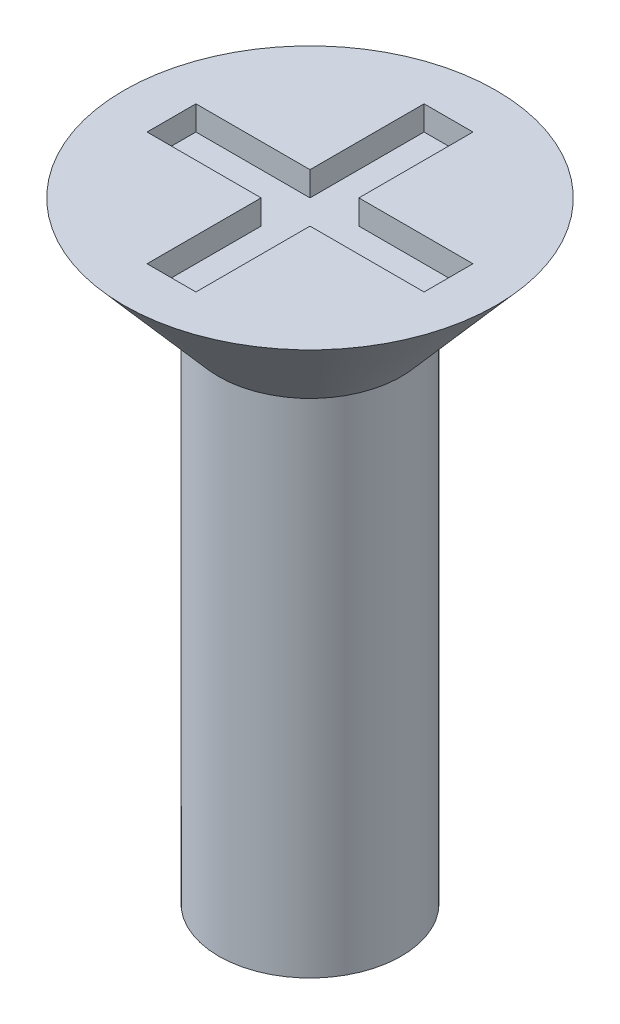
ISO-10303-21;
HEADER;
FILE_DESCRIPTION(('STEP AP214'),'2;1');
FILE_NAME('part.step','',(''),(''),'','','');
FILE_SCHEMA(('AUTOMOTIVE_DESIGN { 1 0 10303 214 1 1 1 1 }'));
ENDSEC;
DATA;
#1=APPLICATION_CONTEXT('core data for automotive mechanical design processes');
#2=APPLICATION_PROTOCOL_DEFINITION('international standard','automotive_design',2000,#1);
#3=PRODUCT_CONTEXT('',#1,'mechanical');
#4=PRODUCT('Part','Part','',(#3));
#5=PRODUCT_RELATED_PRODUCT_CATEGORY('part','',(#4));
#6=PRODUCT_DEFINITION_FORMATION('','',#4);
#7=PRODUCT_DEFINITION_CONTEXT('part definition',#1,'design');
#8=PRODUCT_DEFINITION('design','',#6,#7);
#9=PRODUCT_DEFINITION_SHAPE('','',#8);
#10=(LENGTH_UNIT() NAMED_UNIT(*) SI_UNIT(.MILLI.,.METRE.));
#11=(NAMED_UNIT(*) PLANE_ANGLE_UNIT() SI_UNIT($,.RADIAN.));
#12=(NAMED_UNIT(*) SI_UNIT($,.STERADIAN.) SOLID_ANGLE_UNIT());
#13=UNCERTAINTY_MEASURE_WITH_UNIT(LENGTH_MEASURE(1.E-05),#10,'distance_accuracy_value','');
#14=(GEOMETRIC_REPRESENTATION_CONTEXT(3) GLOBAL_UNCERTAINTY_ASSIGNED_CONTEXT((#13)) GLOBAL_UNIT_ASSIGNED_CONTEXT((#10,
#11,#12)) REPRESENTATION_CONTEXT('',''));
#15=CARTESIAN_POINT('',(0.,0.,0.));
#16=DIRECTION('',(0.,0.,1.));
#17=DIRECTION('',(1.,0.,0.));
#18=AXIS2_PLACEMENT_3D('',#15,#16,#17);
#19=CARTESIAN_POINT('',(2.90175217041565,9.525,0.));
#20=DIRECTION('',(0.,-1.,0.));
#21=DIRECTION('',(0.,0.,-1.));
#22=AXIS2_PLACEMENT_3D('',#19,#20,#21);
#23=PLANE('',#22);
#24=CARTESIAN_POINT('',(0.,9.52500000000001,0.));
#25=DIRECTION('',(0.,1.,0.));
#26=DIRECTION('',(0.,0.,1.));
#27=AXIS2_PLACEMENT_3D('',#24,#25,#26);
#28=CIRCLE('',#27,2.90175217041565);
#29=CARTESIAN_POINT('',(0.,9.52500000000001,2.90175217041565));
#30=VERTEX_POINT('',#29);
#31=EDGE_CURVE('E230',#30,#30,#28,.T.);
#32=ORIENTED_EDGE('',*,*,#31,.T.);
#33=EDGE_LOOP('',(#32));
#34=FACE_BOUND('',#33,.T.);
#35=DIRECTION('',(-1.,0.,1.49574716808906E-09));
#36=VECTOR('',#35,1.);
#37=CARTESIAN_POINT('',(5.69879661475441E-10,9.525,0.381));
#38=LINE('',#37,#36);
#39=CARTESIAN_POINT('',(-0.381,9.525,0.381000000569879));
#40=VERTEX_POINT('',#39);
#41=CARTESIAN_POINT('',(-2.15899999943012,9.525,0.381000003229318));
#42=VERTEX_POINT('',#41);
#43=EDGE_CURVE('E188',#40,#42,#38,.T.);
#44=ORIENTED_EDGE('',*,*,#43,.T.);
#45=DIRECTION('',(1.49574714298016E-09,0.,1.));
#46=VECTOR('',#45,1.);
#47=CARTESIAN_POINT('',(-2.15900000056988,9.525,-0.380999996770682));
#48=LINE('',#47,#46);
#49=CARTESIAN_POINT('',(-2.15900000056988,9.525,-0.380999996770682));
#50=VERTEX_POINT('',#49);
#51=EDGE_CURVE('E200',#50,#42,#48,.T.);
#52=ORIENTED_EDGE('',*,*,#51,.F.);
#53=DIRECTION('',(1.,0.,-1.49574729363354E-09));
#54=VECTOR('',#53,1.);
#55=CARTESIAN_POINT('',(-2.15900000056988,9.525,-0.380999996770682));
#56=LINE('',#55,#54);
#57=CARTESIAN_POINT('',(-0.381000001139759,9.525,-0.381));
#58=VERTEX_POINT('',#57);
#59=EDGE_CURVE('E203',#50,#58,#56,.T.);
#60=ORIENTED_EDGE('',*,*,#59,.T.);
#61=DIRECTION('',(-2.99149431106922E-09,0.,-1.));
#62=VECTOR('',#61,1.);
#63=CARTESIAN_POINT('',(-0.381,9.525,1.13975932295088E-09));
#64=LINE('',#63,#62);
#65=CARTESIAN_POINT('',(-0.381000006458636,9.525,-2.15899999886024));
#66=VERTEX_POINT('',#65);
#67=EDGE_CURVE('E166',#58,#66,#64,.T.);
#68=ORIENTED_EDGE('',*,*,#67,.T.);
#69=DIRECTION('',(-1.,0.,2.99149428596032E-09));
#70=VECTOR('',#69,1.);
#71=CARTESIAN_POINT('',(0.380999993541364,9.525,-2.15900000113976));
#72=LINE('',#71,#70);
#73=CARTESIAN_POINT('',(0.380999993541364,9.525,-2.15900000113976));
#74=VERTEX_POINT('',#73);
#75=EDGE_CURVE('E178',#74,#66,#72,.T.);
#76=ORIENTED_EDGE('',*,*,#75,.F.);
#77=DIRECTION('',(2.99149443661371E-09,0.,1.));
#78=VECTOR('',#77,1.);
#79=CARTESIAN_POINT('',(0.380999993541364,9.525,-2.15900000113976));
#80=LINE('',#79,#78);
#81=CARTESIAN_POINT('',(0.381,9.525,-0.381000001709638));
#82=VERTEX_POINT('',#81);
#83=EDGE_CURVE('E170',#74,#82,#80,.T.);
#84=ORIENTED_EDGE('',*,*,#83,.T.);
#85=DIRECTION('',(1.,0.,-4.48724100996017E-09));
#86=VECTOR('',#85,1.);
#87=CARTESIAN_POINT('',(-1.70963881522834E-09,9.525,-0.381));
#88=LINE('',#87,#86);
#89=CARTESIAN_POINT('',(2.15899999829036,9.525,-0.381000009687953));
#90=VERTEX_POINT('',#89);
#91=EDGE_CURVE('E162',#82,#90,#88,.T.);
#92=ORIENTED_EDGE('',*,*,#91,.T.);
#93=DIRECTION('',(-4.48724098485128E-09,0.,-1.));
#94=VECTOR('',#93,1.);
#95=CARTESIAN_POINT('',(2.15900000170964,9.525,0.380999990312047));
#96=LINE('',#95,#94);
#97=CARTESIAN_POINT('',(2.15900000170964,9.525,0.380999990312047));
#98=VERTEX_POINT('',#97);
#99=EDGE_CURVE('E145',#98,#90,#96,.T.);
#100=ORIENTED_EDGE('',*,*,#99,.F.);
#101=CARTESIAN_POINT('',(0.381,9.525,0.38099999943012));
#102=VERTEX_POINT('',#101);
#103=EDGE_CURVE('E198',#98,#102,#38,.T.);
#104=ORIENTED_EDGE('',*,*,#103,.T.);
#105=DIRECTION('',(0.,0.,1.));
#106=VECTOR('',#105,1.);
#107=CARTESIAN_POINT('',(0.381,9.525,0.));
#108=LINE('',#107,#106);
#109=CARTESIAN_POINT('',(0.381,9.525,2.159));
#110=VERTEX_POINT('',#109);
#111=EDGE_CURVE('E67',#102,#110,#108,.T.);
#112=ORIENTED_EDGE('',*,*,#111,.T.);
#113=DIRECTION('',(1.,0.,0.));
#114=VECTOR('',#113,1.);
#115=CARTESIAN_POINT('',(-0.381,9.525,2.159));
#116=LINE('',#115,#114);
#117=CARTESIAN_POINT('',(-0.381,9.525,2.159));
#118=VERTEX_POINT('',#117);
#119=EDGE_CURVE('E222',#118,#110,#116,.T.);
#120=ORIENTED_EDGE('',*,*,#119,.F.);
#121=DIRECTION('',(0.,0.,-1.));
#122=VECTOR('',#121,1.);
#123=CARTESIAN_POINT('',(-0.381,9.525,2.159));
#124=LINE('',#123,#122);
#125=EDGE_CURVE('E216',#118,#40,#124,.T.);
#126=ORIENTED_EDGE('',*,*,#125,.T.);
#127=EDGE_LOOP('',(#44,#52,#60,#68,#76,#84,#92,#100,#104,#112,#120,#126));
#128=FACE_BOUND('',#127,.T.);
#129=ADVANCED_FACE('F38',(#34,#128),#23,.F.);
#130=CARTESIAN_POINT('',(0.381,9.144,0.));
#131=DIRECTION('',(-1.,0.,0.));
#132=DIRECTION('',(0.,0.,1.));
#133=AXIS2_PLACEMENT_3D('',#130,#131,#132);
#134=PLANE('',#133);
#135=ORIENTED_EDGE('',*,*,#111,.F.);
#136=DIRECTION('',(0.,-1.,0.));
#137=VECTOR('',#136,1.);
#138=CARTESIAN_POINT('',(0.381,9.144,0.38099999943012));
#139=LINE('',#138,#137);
#140=CARTESIAN_POINT('',(0.381,9.144,0.38099999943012));
#141=VERTEX_POINT('',#140);
#142=EDGE_CURVE('E210',#102,#141,#139,.T.);
#143=ORIENTED_EDGE('',*,*,#142,.T.);
#144=DIRECTION('',(0.,0.,1.));
#145=VECTOR('',#144,1.);
#146=CARTESIAN_POINT('',(0.381,9.144,0.));
#147=LINE('',#146,#145);
#148=CARTESIAN_POINT('',(0.381,9.144,2.159));
#149=VERTEX_POINT('',#148);
#150=EDGE_CURVE('E213',#141,#149,#147,.T.);
#151=ORIENTED_EDGE('',*,*,#150,.T.);
#152=DIRECTION('',(0.,1.,0.));
#153=VECTOR('',#152,1.);
#154=CARTESIAN_POINT('',(0.381,9.144,2.159));
#155=LINE('',#154,#153);
#156=EDGE_CURVE('E228',#149,#110,#155,.T.);
#157=ORIENTED_EDGE('',*,*,#156,.T.);
#158=EDGE_LOOP('',(#135,#143,#151,#157));
#159=FACE_BOUND('',#158,.T.);
#160=ADVANCED_FACE('F247',(#159),#134,.T.);
#161=CARTESIAN_POINT('',(-0.381,9.144,2.159));
#162=DIRECTION('',(1.,0.,0.));
#163=DIRECTION('',(0.,0.,-1.));
#164=AXIS2_PLACEMENT_3D('',#161,#162,#163);
#165=PLANE('',#164);
#166=DIRECTION('',(0.,0.,-1.));
#167=VECTOR('',#166,1.);
#168=CARTESIAN_POINT('',(-0.381,9.144,2.159));
#169=LINE('',#168,#167);
#170=CARTESIAN_POINT('',(-0.381,9.144,2.159));
#171=VERTEX_POINT('',#170);
#172=CARTESIAN_POINT('',(-0.381,9.144,0.381000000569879));
#173=VERTEX_POINT('',#172);
#174=EDGE_CURVE('E219',#171,#173,#169,.T.);
#175=ORIENTED_EDGE('',*,*,#174,.T.);
#176=DIRECTION('',(0.,1.,0.));
#177=VECTOR('',#176,1.);
#178=CARTESIAN_POINT('',(-0.381,9.144,0.381000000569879));
#179=LINE('',#178,#177);
#180=EDGE_CURVE('E75',#173,#40,#179,.T.);
#181=ORIENTED_EDGE('',*,*,#180,.T.);
#182=ORIENTED_EDGE('',*,*,#125,.F.);
#183=DIRECTION('',(0.,1.,0.));
#184=VECTOR('',#183,1.);
#185=CARTESIAN_POINT('',(-0.381,9.144,2.159));
#186=LINE('',#185,#184);
#187=EDGE_CURVE('E55',#171,#118,#186,.T.);
#188=ORIENTED_EDGE('',*,*,#187,.F.);
#189=EDGE_LOOP('',(#175,#181,#182,#188));
#190=FACE_BOUND('',#189,.T.);
#191=ADVANCED_FACE('F243',(#190),#165,.T.);
#192=CARTESIAN_POINT('',(0.,0.,0.));
#193=DIRECTION('',(0.,1.,0.));
#194=DIRECTION('',(0.,0.,1.));
#195=AXIS2_PLACEMENT_3D('',#192,#193,#194);
#196=PLANE('',#195);
#197=CARTESIAN_POINT('',(0.,0.,0.));
#198=DIRECTION('',(0.,1.,0.));
#199=DIRECTION('',(0.,0.,1.));
#200=AXIS2_PLACEMENT_3D('',#197,#198,#199);
#201=CIRCLE('',#200,1.42240000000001);
#202=CARTESIAN_POINT('',(0.,0.,1.42240000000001));
#203=VERTEX_POINT('',#202);
#204=EDGE_CURVE('E11',#203,#203,#201,.T.);
#205=ORIENTED_EDGE('',*,*,#204,.F.);
#206=EDGE_LOOP('',(#205));
#207=FACE_BOUND('',#206,.T.);
#208=ADVANCED_FACE('F40',(#207),#196,.F.);
#209=CARTESIAN_POINT('',(0.,90.8693037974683,0.));
#210=DIRECTION('',(0.,1.,0.));
#211=DIRECTION('',(0.,0.,1.));
#212=AXIS2_PLACEMENT_3D('',#209,#210,#211);
#213=CYLINDRICAL_SURFACE('',#212,1.42240000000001);
#214=CARTESIAN_POINT('',(0.,7.8232,0.));
#215=DIRECTION('',(0.,1.,0.));
#216=DIRECTION('',(0.,0.,1.));
#217=AXIS2_PLACEMENT_3D('',#214,#215,#216);
#218=CIRCLE('',#217,1.42240000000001);
#219=CARTESIAN_POINT('',(0.,7.8232,1.42240000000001));
#220=VERTEX_POINT('',#219);
#221=EDGE_CURVE('E47',#220,#220,#218,.T.);
#222=ORIENTED_EDGE('',*,*,#221,.F.);
#223=EDGE_LOOP('',(#222));
#224=FACE_BOUND('',#223,.T.);
#225=ORIENTED_EDGE('',*,*,#204,.T.);
#226=EDGE_LOOP('',(#225));
#227=FACE_BOUND('',#226,.T.);
#228=ADVANCED_FACE('F237',(#224,#227),#213,.T.);
#229=CARTESIAN_POINT('',(0.,7.8232,0.));
#230=DIRECTION('',(0.,1.,0.));
#231=DIRECTION('',(0.,0.,1.));
#232=AXIS2_PLACEMENT_3D('',#229,#230,#231);
#233=CONICAL_SURFACE('',#232,1.42240000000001,0.715584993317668);
#234=ORIENTED_EDGE('',*,*,#31,.F.);
#235=EDGE_LOOP('',(#234));
#236=FACE_BOUND('',#235,.T.);
#237=ORIENTED_EDGE('',*,*,#221,.T.);
#238=EDGE_LOOP('',(#237));
#239=FACE_BOUND('',#238,.T.);
#240=ADVANCED_FACE('F235',(#236,#239),#233,.T.);
#241=CARTESIAN_POINT('',(-0.381,9.144,2.159));
#242=DIRECTION('',(0.,0.,1.));
#243=DIRECTION('',(1.,0.,0.));
#244=AXIS2_PLACEMENT_3D('',#241,#242,#243);
#245=PLANE('',#244);
#246=ORIENTED_EDGE('',*,*,#119,.T.);
#247=ORIENTED_EDGE('',*,*,#156,.F.);
#248=DIRECTION('',(1.,0.,0.));
#249=VECTOR('',#248,1.);
#250=CARTESIAN_POINT('',(-0.381,9.144,2.159));
#251=LINE('',#250,#249);
#252=EDGE_CURVE('E215',#171,#149,#251,.T.);
#253=ORIENTED_EDGE('',*,*,#252,.F.);
#254=ORIENTED_EDGE('',*,*,#187,.T.);
#255=EDGE_LOOP('',(#246,#247,#253,#254));
#256=FACE_BOUND('',#255,.T.);
#257=ADVANCED_FACE('F260',(#256),#245,.F.);
#258=CARTESIAN_POINT('',(0.381,9.144,2.159));
#259=DIRECTION('',(0.,1.,0.));
#260=DIRECTION('',(0.,0.,1.));
#261=AXIS2_PLACEMENT_3D('',#258,#259,#260);
#262=PLANE('',#261);
#263=ORIENTED_EDGE('',*,*,#150,.F.);
#264=DIRECTION('',(-1.,0.,1.49574716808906E-09));
#265=VECTOR('',#264,1.);
#266=CARTESIAN_POINT('',(5.69879661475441E-10,9.144,0.381));
#267=LINE('',#266,#265);
#268=CARTESIAN_POINT('',(2.15900000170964,9.144,0.380999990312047));
#269=VERTEX_POINT('',#268);
#270=EDGE_CURVE('E157',#269,#141,#267,.T.);
#271=ORIENTED_EDGE('',*,*,#270,.F.);
#272=DIRECTION('',(-4.48724098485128E-09,0.,-1.));
#273=VECTOR('',#272,1.);
#274=CARTESIAN_POINT('',(2.15900000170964,9.144,0.380999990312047));
#275=LINE('',#274,#273);
#276=CARTESIAN_POINT('',(2.15899999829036,9.144,-0.381000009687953));
#277=VERTEX_POINT('',#276);
#278=EDGE_CURVE('E144',#269,#277,#275,.T.);
#279=ORIENTED_EDGE('',*,*,#278,.T.);
#280=DIRECTION('',(1.,0.,-4.48724100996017E-09));
#281=VECTOR('',#280,1.);
#282=CARTESIAN_POINT('',(-1.70963881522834E-09,9.144,-0.381));
#283=LINE('',#282,#281);
#284=CARTESIAN_POINT('',(0.381,9.144,-0.381000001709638));
#285=VERTEX_POINT('',#284);
#286=EDGE_CURVE('E133',#285,#277,#283,.T.);
#287=ORIENTED_EDGE('',*,*,#286,.F.);
#288=DIRECTION('',(2.99149443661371E-09,0.,1.));
#289=VECTOR('',#288,1.);
#290=CARTESIAN_POINT('',(0.380999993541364,9.144,-2.15900000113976));
#291=LINE('',#290,#289);
#292=CARTESIAN_POINT('',(0.380999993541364,9.144,-2.15900000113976));
#293=VERTEX_POINT('',#292);
#294=EDGE_CURVE('E173',#293,#285,#291,.T.);
#295=ORIENTED_EDGE('',*,*,#294,.F.);
#296=DIRECTION('',(-1.,0.,2.99149428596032E-09));
#297=VECTOR('',#296,1.);
#298=CARTESIAN_POINT('',(0.380999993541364,9.144,-2.15900000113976));
#299=LINE('',#298,#297);
#300=CARTESIAN_POINT('',(-0.381000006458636,9.144,-2.15899999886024));
#301=VERTEX_POINT('',#300);
#302=EDGE_CURVE('E169',#293,#301,#299,.T.);
#303=ORIENTED_EDGE('',*,*,#302,.T.);
#304=DIRECTION('',(-2.99149431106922E-09,0.,-1.));
#305=VECTOR('',#304,1.);
#306=CARTESIAN_POINT('',(-0.381,9.144,1.13975932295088E-09));
#307=LINE('',#306,#305);
#308=CARTESIAN_POINT('',(-0.381000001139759,9.144,-0.381));
#309=VERTEX_POINT('',#308);
#310=EDGE_CURVE('E167',#309,#301,#307,.T.);
#311=ORIENTED_EDGE('',*,*,#310,.F.);
#312=DIRECTION('',(1.,0.,-1.49574729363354E-09));
#313=VECTOR('',#312,1.);
#314=CARTESIAN_POINT('',(-2.15900000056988,9.144,-0.380999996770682));
#315=LINE('',#314,#313);
#316=CARTESIAN_POINT('',(-2.15900000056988,9.144,-0.380999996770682));
#317=VERTEX_POINT('',#316);
#318=EDGE_CURVE('E194',#317,#309,#315,.T.);
#319=ORIENTED_EDGE('',*,*,#318,.F.);
#320=DIRECTION('',(1.49574714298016E-09,0.,1.));
#321=VECTOR('',#320,1.);
#322=CARTESIAN_POINT('',(-2.15900000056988,9.144,-0.380999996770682));
#323=LINE('',#322,#321);
#324=CARTESIAN_POINT('',(-2.15899999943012,9.144,0.381000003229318));
#325=VERTEX_POINT('',#324);
#326=EDGE_CURVE('E190',#317,#325,#323,.T.);
#327=ORIENTED_EDGE('',*,*,#326,.T.);
#328=EDGE_CURVE('E191',#173,#325,#267,.T.);
#329=ORIENTED_EDGE('',*,*,#328,.F.);
#330=ORIENTED_EDGE('',*,*,#174,.F.);
#331=ORIENTED_EDGE('',*,*,#252,.T.);
#332=EDGE_LOOP('',(#263,#271,#279,#287,#295,#303,#311,#319,#327,#329,#330,#331));
#333=FACE_BOUND('',#332,.T.);
#334=ADVANCED_FACE('F156',(#333),#262,.T.);
#335=CARTESIAN_POINT('',(5.69879661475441E-10,9.144,0.381));
#336=DIRECTION('',(-1.49574716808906E-09,0.,-1.));
#337=DIRECTION('',(-1.,0.,1.49574716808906E-09));
#338=AXIS2_PLACEMENT_3D('',#335,#336,#337);
#339=PLANE('',#338);
#340=ORIENTED_EDGE('',*,*,#103,.F.);
#341=DIRECTION('',(0.,1.,0.));
#342=VECTOR('',#341,1.);
#343=CARTESIAN_POINT('',(2.15900000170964,9.144,0.380999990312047));
#344=LINE('',#343,#342);
#345=EDGE_CURVE('E153',#269,#98,#344,.T.);
#346=ORIENTED_EDGE('',*,*,#345,.F.);
#347=ORIENTED_EDGE('',*,*,#270,.T.);
#348=ORIENTED_EDGE('',*,*,#142,.F.);
#349=EDGE_LOOP('',(#340,#346,#347,#348));
#350=FACE_BOUND('',#349,.T.);
#351=ADVANCED_FACE('F270',(#350),#339,.T.);
#352=CARTESIAN_POINT('',(-2.15900000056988,9.144,-0.380999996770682));
#353=DIRECTION('',(1.49574729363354E-09,0.,1.));
#354=DIRECTION('',(1.,0.,-1.49574729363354E-09));
#355=AXIS2_PLACEMENT_3D('',#352,#353,#354);
#356=PLANE('',#355);
#357=DIRECTION('',(0.,1.,0.));
#358=VECTOR('',#357,1.);
#359=CARTESIAN_POINT('',(-0.381000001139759,9.144,-0.380999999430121));
#360=LINE('',#359,#358);
#361=EDGE_CURVE('E186',#309,#58,#360,.T.);
#362=ORIENTED_EDGE('',*,*,#361,.T.);
#363=ORIENTED_EDGE('',*,*,#59,.F.);
#364=DIRECTION('',(0.,1.,0.));
#365=VECTOR('',#364,1.);
#366=CARTESIAN_POINT('',(-2.15900000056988,9.144,-0.380999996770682));
#367=LINE('',#366,#365);
#368=EDGE_CURVE('E197',#317,#50,#367,.T.);
#369=ORIENTED_EDGE('',*,*,#368,.F.);
#370=ORIENTED_EDGE('',*,*,#318,.T.);
#371=EDGE_LOOP('',(#362,#363,#369,#370));
#372=FACE_BOUND('',#371,.T.);
#373=ADVANCED_FACE('F277',(#372),#356,.T.);
#374=ORIENTED_EDGE('',*,*,#328,.T.);
#375=DIRECTION('',(0.,1.,0.));
#376=VECTOR('',#375,1.);
#377=CARTESIAN_POINT('',(-2.15899999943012,9.144,0.381000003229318));
#378=LINE('',#377,#376);
#379=EDGE_CURVE('E207',#325,#42,#378,.T.);
#380=ORIENTED_EDGE('',*,*,#379,.T.);
#381=ORIENTED_EDGE('',*,*,#43,.F.);
#382=ORIENTED_EDGE('',*,*,#180,.F.);
#383=EDGE_LOOP('',(#374,#380,#381,#382));
#384=FACE_BOUND('',#383,.T.);
#385=ADVANCED_FACE('F273',(#384),#339,.T.);
#386=CARTESIAN_POINT('',(-2.15900000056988,9.144,-0.380999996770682));
#387=DIRECTION('',(-1.,0.,1.49574714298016E-09));
#388=DIRECTION('',(1.49574714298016E-09,0.,1.));
#389=AXIS2_PLACEMENT_3D('',#386,#387,#388);
#390=PLANE('',#389);
#391=ORIENTED_EDGE('',*,*,#51,.T.);
#392=ORIENTED_EDGE('',*,*,#379,.F.);
#393=ORIENTED_EDGE('',*,*,#326,.F.);
#394=ORIENTED_EDGE('',*,*,#368,.T.);
#395=EDGE_LOOP('',(#391,#392,#393,#394));
#396=FACE_BOUND('',#395,.T.);
#397=ADVANCED_FACE('F276',(#396),#390,.F.);
#398=CARTESIAN_POINT('',(-0.381,9.144,1.13975932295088E-09));
#399=DIRECTION('',(1.,0.,-2.99149431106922E-09));
#400=DIRECTION('',(-2.99149431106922E-09,0.,-1.));
#401=AXIS2_PLACEMENT_3D('',#398,#399,#400);
#402=PLANE('',#401);
#403=ORIENTED_EDGE('',*,*,#310,.T.);
#404=DIRECTION('',(0.,1.,0.));
#405=VECTOR('',#404,1.);
#406=CARTESIAN_POINT('',(-0.381000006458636,9.144,-2.15899999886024));
#407=LINE('',#406,#405);
#408=EDGE_CURVE('E184',#301,#66,#407,.T.);
#409=ORIENTED_EDGE('',*,*,#408,.T.);
#410=ORIENTED_EDGE('',*,*,#67,.F.);
#411=ORIENTED_EDGE('',*,*,#361,.F.);
#412=EDGE_LOOP('',(#403,#409,#410,#411));
#413=FACE_BOUND('',#412,.T.);
#414=ADVANCED_FACE('F280',(#413),#402,.T.);
#415=CARTESIAN_POINT('',(0.380999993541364,9.144,-2.15900000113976));
#416=DIRECTION('',(-1.,0.,2.99149443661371E-09));
#417=DIRECTION('',(2.99149443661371E-09,0.,1.));
#418=AXIS2_PLACEMENT_3D('',#415,#416,#417);
#419=PLANE('',#418);
#420=DIRECTION('',(0.,1.,0.));
#421=VECTOR('',#420,1.);
#422=CARTESIAN_POINT('',(0.380999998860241,9.144,-0.381000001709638));
#423=LINE('',#422,#421);
#424=EDGE_CURVE('E139',#285,#82,#423,.T.);
#425=ORIENTED_EDGE('',*,*,#424,.T.);
#426=ORIENTED_EDGE('',*,*,#83,.F.);
#427=DIRECTION('',(0.,1.,0.));
#428=VECTOR('',#427,1.);
#429=CARTESIAN_POINT('',(0.380999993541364,9.144,-2.15900000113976));
#430=LINE('',#429,#428);
#431=EDGE_CURVE('E175',#293,#74,#430,.T.);
#432=ORIENTED_EDGE('',*,*,#431,.F.);
#433=ORIENTED_EDGE('',*,*,#294,.T.);
#434=EDGE_LOOP('',(#425,#426,#432,#433));
#435=FACE_BOUND('',#434,.T.);
#436=ADVANCED_FACE('F287',(#435),#419,.T.);
#437=CARTESIAN_POINT('',(0.380999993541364,9.144,-2.15900000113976));
#438=DIRECTION('',(-2.99149428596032E-09,0.,-1.));
#439=DIRECTION('',(-1.,0.,2.99149428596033E-09));
#440=AXIS2_PLACEMENT_3D('',#437,#438,#439);
#441=PLANE('',#440);
#442=ORIENTED_EDGE('',*,*,#75,.T.);
#443=ORIENTED_EDGE('',*,*,#408,.F.);
#444=ORIENTED_EDGE('',*,*,#302,.F.);
#445=ORIENTED_EDGE('',*,*,#431,.T.);
#446=EDGE_LOOP('',(#442,#443,#444,#445));
#447=FACE_BOUND('',#446,.T.);
#448=ADVANCED_FACE('F289',(#447),#441,.F.);
#449=CARTESIAN_POINT('',(-1.70963881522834E-09,9.144,-0.381));
#450=DIRECTION('',(4.48724100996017E-09,0.,1.));
#451=DIRECTION('',(1.,0.,-4.48724100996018E-09));
#452=AXIS2_PLACEMENT_3D('',#449,#450,#451);
#453=PLANE('',#452);
#454=ORIENTED_EDGE('',*,*,#286,.T.);
#455=DIRECTION('',(0.,1.,0.));
#456=VECTOR('',#455,1.);
#457=CARTESIAN_POINT('',(2.15899999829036,9.144,-0.381000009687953));
#458=LINE('',#457,#456);
#459=EDGE_CURVE('E137',#277,#90,#458,.T.);
#460=ORIENTED_EDGE('',*,*,#459,.T.);
#461=ORIENTED_EDGE('',*,*,#91,.F.);
#462=ORIENTED_EDGE('',*,*,#424,.F.);
#463=EDGE_LOOP('',(#454,#460,#461,#462));
#464=FACE_BOUND('',#463,.T.);
#465=ADVANCED_FACE('F135',(#464),#453,.T.);
#466=CARTESIAN_POINT('',(2.15900000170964,9.144,0.380999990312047));
#467=DIRECTION('',(1.,0.,-4.48724098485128E-09));
#468=DIRECTION('',(-4.48724098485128E-09,0.,-1.));
#469=AXIS2_PLACEMENT_3D('',#466,#467,#468);
#470=PLANE('',#469);
#471=ORIENTED_EDGE('',*,*,#99,.T.);
#472=ORIENTED_EDGE('',*,*,#459,.F.);
#473=ORIENTED_EDGE('',*,*,#278,.F.);
#474=ORIENTED_EDGE('',*,*,#345,.T.);
#475=EDGE_LOOP('',(#471,#472,#473,#474));
#476=FACE_BOUND('',#475,.T.);
#477=ADVANCED_FACE('F149',(#476),#470,.F.);
#478=CLOSED_SHELL('',(#129,#160,#191,#208,#228,#240,#257,#334,#351,#373,#385,#397,#414,#436,
#448,#465,#477));
#479=MANIFOLD_SOLID_BREP('B2',#478);
#480=ADVANCED_BREP_SHAPE_REPRESENTATION('',(#18,#479),#14);
#481=SHAPE_DEFINITION_REPRESENTATION(#9,#480);
ENDSEC;
END-ISO-10303-21;
